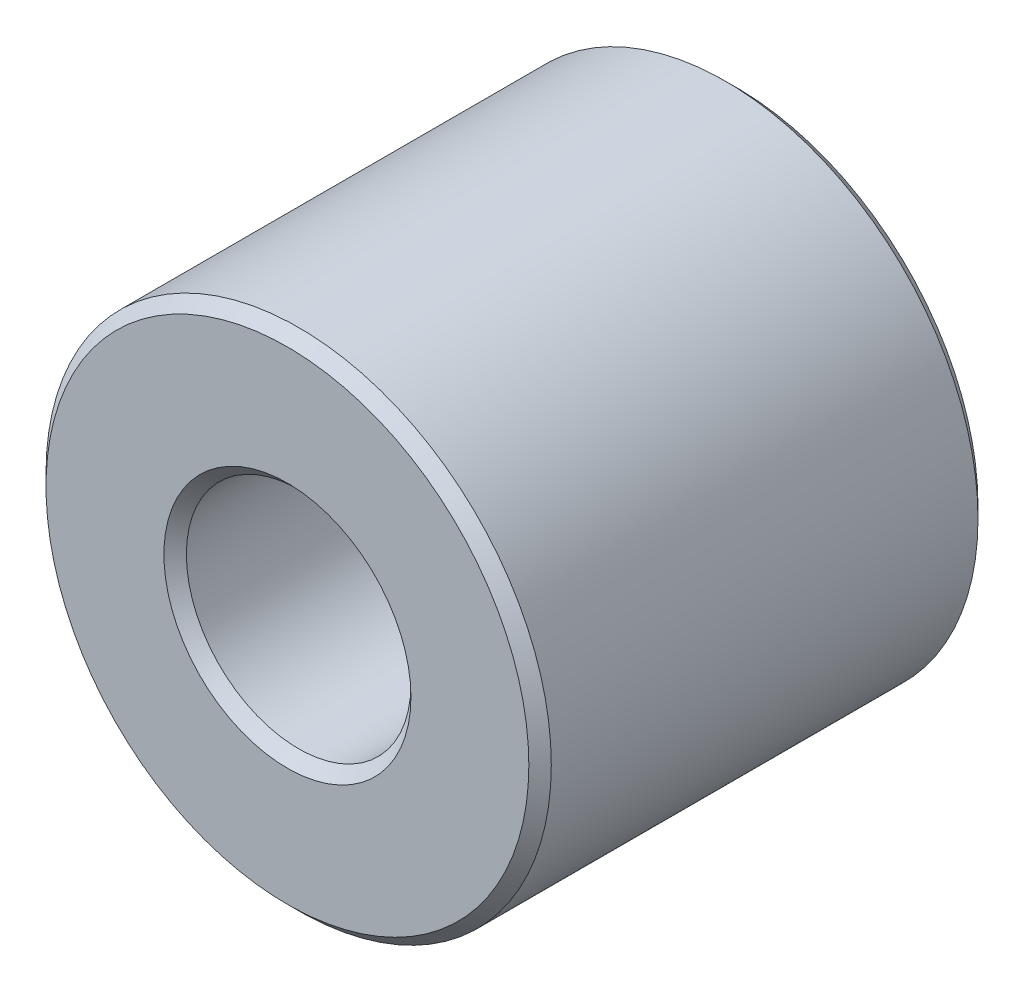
ISO-10303-21;
HEADER;
FILE_DESCRIPTION(('STEP AP214'),'2;1');
FILE_NAME('part.step','',(''),(''),'','','');
FILE_SCHEMA(('AUTOMOTIVE_DESIGN { 1 0 10303 214 1 1 1 1 }'));
ENDSEC;
DATA;
#1=APPLICATION_CONTEXT('core data for automotive mechanical design processes');
#2=APPLICATION_PROTOCOL_DEFINITION('international standard','automotive_design',2000,#1);
#3=PRODUCT_CONTEXT('',#1,'mechanical');
#4=PRODUCT('Part','Part','',(#3));
#5=PRODUCT_RELATED_PRODUCT_CATEGORY('part','',(#4));
#6=PRODUCT_DEFINITION_FORMATION('','',#4);
#7=PRODUCT_DEFINITION_CONTEXT('part definition',#1,'design');
#8=PRODUCT_DEFINITION('design','',#6,#7);
#9=PRODUCT_DEFINITION_SHAPE('','',#8);
#10=(LENGTH_UNIT() NAMED_UNIT(*) SI_UNIT(.MILLI.,.METRE.));
#11=(NAMED_UNIT(*) PLANE_ANGLE_UNIT() SI_UNIT($,.RADIAN.));
#12=(NAMED_UNIT(*) SI_UNIT($,.STERADIAN.) SOLID_ANGLE_UNIT());
#13=UNCERTAINTY_MEASURE_WITH_UNIT(LENGTH_MEASURE(1.E-05),#10,'distance_accuracy_value','');
#14=(GEOMETRIC_REPRESENTATION_CONTEXT(3) GLOBAL_UNCERTAINTY_ASSIGNED_CONTEXT((#13)) GLOBAL_UNIT_ASSIGNED_CONTEXT((#10,
#11,#12)) REPRESENTATION_CONTEXT('',''));
#15=CARTESIAN_POINT('',(0.,0.,0.));
#16=DIRECTION('',(0.,0.,1.));
#17=DIRECTION('',(1.,0.,0.));
#18=AXIS2_PLACEMENT_3D('',#15,#16,#17);
#19=CARTESIAN_POINT('',(0.,0.,20.));
#20=DIRECTION('',(0.,0.,1.));
#21=DIRECTION('',(1.,0.,0.));
#22=AXIS2_PLACEMENT_3D('',#19,#20,#21);
#23=PLANE('',#22);
#24=CARTESIAN_POINT('',(0.,0.,20.));
#25=DIRECTION('',(0.,0.,1.));
#26=DIRECTION('',(1.,0.,0.));
#27=AXIS2_PLACEMENT_3D('',#24,#25,#26);
#28=CIRCLE('',#27,11.);
#29=CARTESIAN_POINT('',(11.,0.,20.));
#30=VERTEX_POINT('',#29);
#31=EDGE_CURVE('E10',#30,#30,#28,.F.);
#32=ORIENTED_EDGE('',*,*,#31,.T.);
#33=EDGE_LOOP('',(#32));
#34=FACE_BOUND('',#33,.T.);
#35=CARTESIAN_POINT('',(0.,0.,20.));
#36=DIRECTION('',(0.,0.,1.));
#37=DIRECTION('',(1.,0.,0.));
#38=AXIS2_PLACEMENT_3D('',#35,#36,#37);
#39=CIRCLE('',#38,21.5);
#40=CARTESIAN_POINT('',(21.5,0.,20.));
#41=VERTEX_POINT('',#40);
#42=EDGE_CURVE('E40',#41,#41,#39,.T.);
#43=ORIENTED_EDGE('',*,*,#42,.T.);
#44=EDGE_LOOP('',(#43));
#45=FACE_BOUND('',#44,.T.);
#46=ADVANCED_FACE('F33',(#34,#45),#23,.T.);
#47=CARTESIAN_POINT('',(0.,0.,-20.));
#48=DIRECTION('',(0.,0.,1.));
#49=DIRECTION('',(1.,0.,0.));
#50=AXIS2_PLACEMENT_3D('',#47,#48,#49);
#51=PLANE('',#50);
#52=CARTESIAN_POINT('',(0.,0.,-20.));
#53=DIRECTION('',(0.,0.,1.));
#54=DIRECTION('',(1.,0.,0.));
#55=AXIS2_PLACEMENT_3D('',#52,#53,#54);
#56=CIRCLE('',#55,11.);
#57=CARTESIAN_POINT('',(11.,0.,-20.));
#58=VERTEX_POINT('',#57);
#59=EDGE_CURVE('E59',#58,#58,#56,.T.);
#60=ORIENTED_EDGE('',*,*,#59,.T.);
#61=EDGE_LOOP('',(#60));
#62=FACE_BOUND('',#61,.T.);
#63=CARTESIAN_POINT('',(0.,0.,-20.));
#64=DIRECTION('',(0.,0.,1.));
#65=DIRECTION('',(1.,0.,0.));
#66=AXIS2_PLACEMENT_3D('',#63,#64,#65);
#67=CIRCLE('',#66,21.5);
#68=CARTESIAN_POINT('',(21.5,0.,-20.));
#69=VERTEX_POINT('',#68);
#70=EDGE_CURVE('E62',#69,#69,#67,.F.);
#71=ORIENTED_EDGE('',*,*,#70,.T.);
#72=EDGE_LOOP('',(#71));
#73=FACE_BOUND('',#72,.T.);
#74=ADVANCED_FACE('F66',(#62,#73),#51,.F.);
#75=CARTESIAN_POINT('',(0.,0.,20.));
#76=DIRECTION('',(0.,0.,-1.));
#77=DIRECTION('',(-1.,0.,0.));
#78=AXIS2_PLACEMENT_3D('',#75,#76,#77);
#79=CYLINDRICAL_SURFACE('',#78,22.5);
#80=CARTESIAN_POINT('',(0.,0.,-19.));
#81=DIRECTION('',(0.,0.,1.));
#82=DIRECTION('',(1.,0.,0.));
#83=AXIS2_PLACEMENT_3D('',#80,#81,#82);
#84=CIRCLE('',#83,22.5);
#85=CARTESIAN_POINT('',(22.5,0.,-19.));
#86=VERTEX_POINT('',#85);
#87=EDGE_CURVE('E44',#86,#86,#84,.T.);
#88=ORIENTED_EDGE('',*,*,#87,.T.);
#89=EDGE_LOOP('',(#88));
#90=FACE_BOUND('',#89,.T.);
#91=CARTESIAN_POINT('',(0.,0.,19.));
#92=DIRECTION('',(0.,0.,1.));
#93=DIRECTION('',(1.,0.,0.));
#94=AXIS2_PLACEMENT_3D('',#91,#92,#93);
#95=CIRCLE('',#94,22.5);
#96=CARTESIAN_POINT('',(22.5,0.,19.));
#97=VERTEX_POINT('',#96);
#98=EDGE_CURVE('E48',#97,#97,#95,.F.);
#99=ORIENTED_EDGE('',*,*,#98,.T.);
#100=EDGE_LOOP('',(#99));
#101=FACE_BOUND('',#100,.T.);
#102=ADVANCED_FACE('F76',(#90,#101),#79,.T.);
#103=CARTESIAN_POINT('',(0.,0.,20.));
#104=DIRECTION('',(0.,0.,-1.));
#105=DIRECTION('',(-1.,0.,0.));
#106=AXIS2_PLACEMENT_3D('',#103,#104,#105);
#107=CYLINDRICAL_SURFACE('',#106,10.);
#108=CARTESIAN_POINT('',(0.,0.,-19.));
#109=DIRECTION('',(0.,0.,1.));
#110=DIRECTION('',(1.,0.,0.));
#111=AXIS2_PLACEMENT_3D('',#108,#109,#110);
#112=CIRCLE('',#111,10.);
#113=CARTESIAN_POINT('',(10.,0.,-19.));
#114=VERTEX_POINT('',#113);
#115=EDGE_CURVE('E53',#114,#114,#112,.F.);
#116=ORIENTED_EDGE('',*,*,#115,.T.);
#117=EDGE_LOOP('',(#116));
#118=FACE_BOUND('',#117,.T.);
#119=CARTESIAN_POINT('',(0.,0.,19.));
#120=DIRECTION('',(0.,0.,1.));
#121=DIRECTION('',(1.,0.,0.));
#122=AXIS2_PLACEMENT_3D('',#119,#120,#121);
#123=CIRCLE('',#122,10.);
#124=CARTESIAN_POINT('',(10.,0.,19.));
#125=VERTEX_POINT('',#124);
#126=EDGE_CURVE('E56',#125,#125,#123,.T.);
#127=ORIENTED_EDGE('',*,*,#126,.T.);
#128=EDGE_LOOP('',(#127));
#129=FACE_BOUND('',#128,.T.);
#130=ADVANCED_FACE('F79',(#118,#129),#107,.F.);
#131=CARTESIAN_POINT('',(0.,0.,-20.));
#132=DIRECTION('',(0.,0.,-1.));
#133=DIRECTION('',(-1.,0.,0.));
#134=AXIS2_PLACEMENT_3D('',#131,#132,#133);
#135=CONICAL_SURFACE('',#134,11.,0.785398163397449);
#136=ORIENTED_EDGE('',*,*,#115,.F.);
#137=EDGE_LOOP('',(#136));
#138=FACE_BOUND('',#137,.T.);
#139=ORIENTED_EDGE('',*,*,#59,.F.);
#140=EDGE_LOOP('',(#139));
#141=FACE_BOUND('',#140,.T.);
#142=ADVANCED_FACE('F72',(#138,#141),#135,.F.);
#143=CARTESIAN_POINT('',(0.,0.,-19.));
#144=DIRECTION('',(0.,0.,1.));
#145=DIRECTION('',(1.,0.,0.));
#146=AXIS2_PLACEMENT_3D('',#143,#144,#145);
#147=CONICAL_SURFACE('',#146,22.5,0.785398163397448);
#148=ORIENTED_EDGE('',*,*,#70,.F.);
#149=EDGE_LOOP('',(#148));
#150=FACE_BOUND('',#149,.T.);
#151=ORIENTED_EDGE('',*,*,#87,.F.);
#152=EDGE_LOOP('',(#151));
#153=FACE_BOUND('',#152,.T.);
#154=ADVANCED_FACE('F68',(#150,#153),#147,.T.);
#155=CARTESIAN_POINT('',(0.,0.,19.));
#156=DIRECTION('',(0.,0.,1.));
#157=DIRECTION('',(1.,0.,0.));
#158=AXIS2_PLACEMENT_3D('',#155,#156,#157);
#159=CONICAL_SURFACE('',#158,10.,0.785398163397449);
#160=ORIENTED_EDGE('',*,*,#31,.F.);
#161=EDGE_LOOP('',(#160));
#162=FACE_BOUND('',#161,.T.);
#163=ORIENTED_EDGE('',*,*,#126,.F.);
#164=EDGE_LOOP('',(#163));
#165=FACE_BOUND('',#164,.T.);
#166=ADVANCED_FACE('F71',(#162,#165),#159,.F.);
#167=CARTESIAN_POINT('',(0.,0.,20.));
#168=DIRECTION('',(0.,0.,-1.));
#169=DIRECTION('',(-1.,0.,0.));
#170=AXIS2_PLACEMENT_3D('',#167,#168,#169);
#171=CONICAL_SURFACE('',#170,21.5,0.78539816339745);
#172=ORIENTED_EDGE('',*,*,#98,.F.);
#173=EDGE_LOOP('',(#172));
#174=FACE_BOUND('',#173,.T.);
#175=ORIENTED_EDGE('',*,*,#42,.F.);
#176=EDGE_LOOP('',(#175));
#177=FACE_BOUND('',#176,.T.);
#178=ADVANCED_FACE('F35',(#174,#177),#171,.T.);
#179=CLOSED_SHELL('',(#46,#74,#102,#130,#142,#154,#166,#178));
#180=MANIFOLD_SOLID_BREP('B2',#179);
#181=ADVANCED_BREP_SHAPE_REPRESENTATION('',(#18,#180),#14);
#182=SHAPE_DEFINITION_REPRESENTATION(#9,#181);
ENDSEC;
END-ISO-10303-21;
